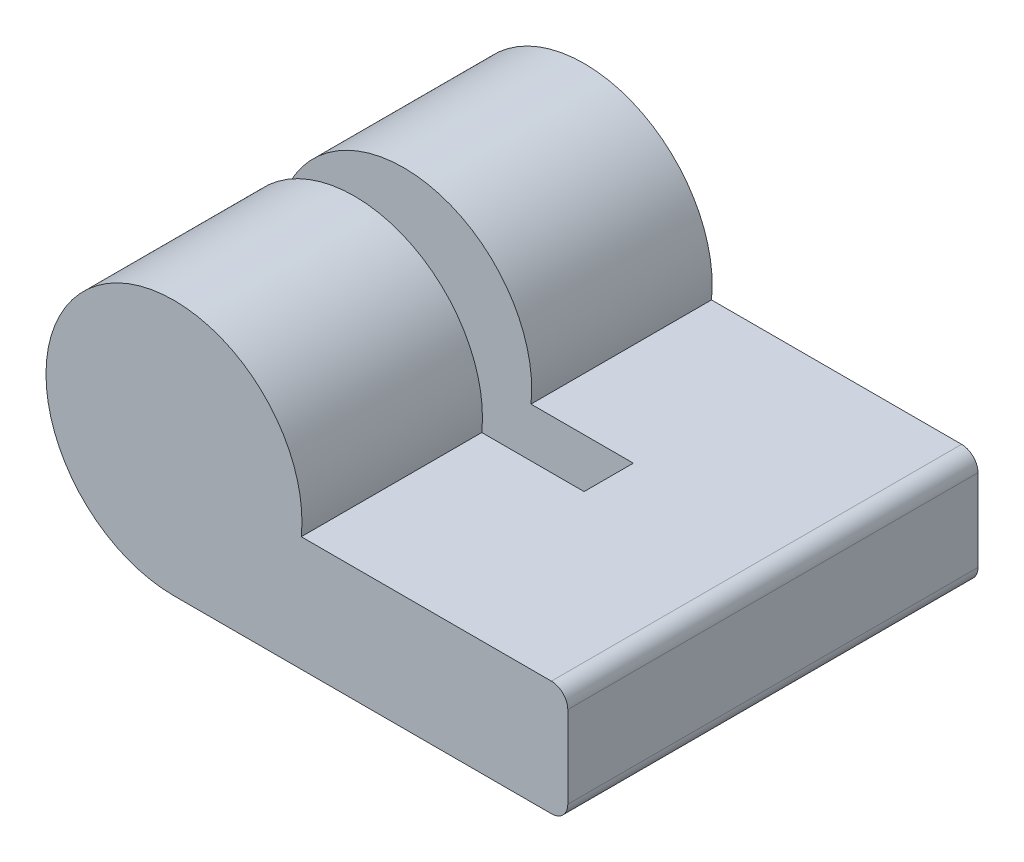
ISO-10303-21;
HEADER;
FILE_DESCRIPTION(('STEP AP214'),'2;1');
FILE_NAME('part.step','',(''),(''),'','','');
FILE_SCHEMA(('AUTOMOTIVE_DESIGN { 1 0 10303 214 1 1 1 1 }'));
ENDSEC;
DATA;
#1=APPLICATION_CONTEXT('core data for automotive mechanical design processes');
#2=APPLICATION_PROTOCOL_DEFINITION('international standard','automotive_design',2000,#1);
#3=PRODUCT_CONTEXT('',#1,'mechanical');
#4=PRODUCT('Part','Part','',(#3));
#5=PRODUCT_RELATED_PRODUCT_CATEGORY('part','',(#4));
#6=PRODUCT_DEFINITION_FORMATION('','',#4);
#7=PRODUCT_DEFINITION_CONTEXT('part definition',#1,'design');
#8=PRODUCT_DEFINITION('design','',#6,#7);
#9=PRODUCT_DEFINITION_SHAPE('','',#8);
#10=(LENGTH_UNIT() NAMED_UNIT(*) SI_UNIT(.MILLI.,.METRE.));
#11=(NAMED_UNIT(*) PLANE_ANGLE_UNIT() SI_UNIT($,.RADIAN.));
#12=(NAMED_UNIT(*) SI_UNIT($,.STERADIAN.) SOLID_ANGLE_UNIT());
#13=UNCERTAINTY_MEASURE_WITH_UNIT(LENGTH_MEASURE(1.E-05),#10,'distance_accuracy_value','');
#14=(GEOMETRIC_REPRESENTATION_CONTEXT(3) GLOBAL_UNCERTAINTY_ASSIGNED_CONTEXT((#13)) GLOBAL_UNIT_ASSIGNED_CONTEXT((#10,
#11,#12)) REPRESENTATION_CONTEXT('',''));
#15=CARTESIAN_POINT('',(0.,0.,0.));
#16=DIRECTION('',(0.,0.,1.));
#17=DIRECTION('',(1.,0.,0.));
#18=AXIS2_PLACEMENT_3D('',#15,#16,#17);
#19=CARTESIAN_POINT('',(0.,0.,12.5));
#20=DIRECTION('',(0.,0.,-1.));
#21=DIRECTION('',(-1.,0.,0.));
#22=AXIS2_PLACEMENT_3D('',#19,#20,#21);
#23=CYLINDRICAL_SURFACE('',#22,3.9);
#24=CARTESIAN_POINT('',(0.,0.,5.5));
#25=DIRECTION('',(0.,0.,1.));
#26=DIRECTION('',(1.,0.,0.));
#27=AXIS2_PLACEMENT_3D('',#24,#25,#26);
#28=CIRCLE('',#27,3.9);
#29=CARTESIAN_POINT('',(3.87943294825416,-0.400000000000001,5.5));
#30=VERTEX_POINT('',#29);
#31=CARTESIAN_POINT('',(0.,-3.9,5.5));
#32=VERTEX_POINT('',#31);
#33=EDGE_CURVE('E130',#30,#32,#28,.T.);
#34=ORIENTED_EDGE('',*,*,#33,.F.);
#35=DIRECTION('',(0.,0.,-1.));
#36=VECTOR('',#35,1.);
#37=CARTESIAN_POINT('',(3.87943294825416,-0.400000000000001,12.5));
#38=LINE('',#37,#36);
#39=CARTESIAN_POINT('',(3.87943294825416,-0.400000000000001,0.));
#40=VERTEX_POINT('',#39);
#41=EDGE_CURVE('E147',#30,#40,#38,.T.);
#42=ORIENTED_EDGE('',*,*,#41,.T.);
#43=CARTESIAN_POINT('',(0.,0.,0.));
#44=DIRECTION('',(0.,0.,1.));
#45=DIRECTION('',(1.,0.,0.));
#46=AXIS2_PLACEMENT_3D('',#43,#44,#45);
#47=CIRCLE('',#46,3.9);
#48=CARTESIAN_POINT('',(0.,-3.9,0.));
#49=VERTEX_POINT('',#48);
#50=EDGE_CURVE('E119',#40,#49,#47,.T.);
#51=ORIENTED_EDGE('',*,*,#50,.T.);
#52=DIRECTION('',(0.,0.,-1.));
#53=VECTOR('',#52,1.);
#54=CARTESIAN_POINT('',(0.,-3.9,12.5));
#55=LINE('',#54,#53);
#56=EDGE_CURVE('E160',#32,#49,#55,.T.);
#57=ORIENTED_EDGE('',*,*,#56,.F.);
#58=EDGE_LOOP('',(#34,#42,#51,#57));
#59=FACE_BOUND('',#58,.T.);
#60=ADVANCED_FACE('F32',(#59),#23,.T.);
#61=CARTESIAN_POINT('',(0.,-3.9,12.5));
#62=DIRECTION('',(0.,1.,0.));
#63=DIRECTION('',(0.,0.,1.));
#64=AXIS2_PLACEMENT_3D('',#61,#62,#63);
#65=PLANE('',#64);
#66=DIRECTION('',(1.,0.,0.));
#67=VECTOR('',#66,1.);
#68=CARTESIAN_POINT('',(0.,-3.9,5.5));
#69=LINE('',#68,#67);
#70=CARTESIAN_POINT('',(3.13256738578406,-3.9,5.5));
#71=VERTEX_POINT('',#70);
#72=EDGE_CURVE('E120',#32,#71,#69,.T.);
#73=ORIENTED_EDGE('',*,*,#72,.F.);
#74=ORIENTED_EDGE('',*,*,#56,.T.);
#75=DIRECTION('',(1.,0.,0.));
#76=VECTOR('',#75,1.);
#77=CARTESIAN_POINT('',(0.,-3.9,0.));
#78=LINE('',#77,#76);
#79=CARTESIAN_POINT('',(11.5,-3.9,0.));
#80=VERTEX_POINT('',#79);
#81=EDGE_CURVE('E150',#49,#80,#78,.T.);
#82=ORIENTED_EDGE('',*,*,#81,.T.);
#83=DIRECTION('',(0.,0.,-1.));
#84=VECTOR('',#83,1.);
#85=CARTESIAN_POINT('',(11.5,-3.9,12.5));
#86=LINE('',#85,#84);
#87=CARTESIAN_POINT('',(11.5,-3.9,12.5));
#88=VERTEX_POINT('',#87);
#89=EDGE_CURVE('E55',#80,#88,#86,.F.);
#90=ORIENTED_EDGE('',*,*,#89,.T.);
#91=DIRECTION('',(1.,0.,0.));
#92=VECTOR('',#91,1.);
#93=CARTESIAN_POINT('',(0.,-3.9,12.5));
#94=LINE('',#93,#92);
#95=CARTESIAN_POINT('',(0.,-3.9,12.5));
#96=VERTEX_POINT('',#95);
#97=EDGE_CURVE('E139',#96,#88,#94,.T.);
#98=ORIENTED_EDGE('',*,*,#97,.F.);
#99=CARTESIAN_POINT('',(0.,-3.9,7.));
#100=VERTEX_POINT('',#99);
#101=EDGE_CURVE('E129',#96,#100,#55,.T.);
#102=ORIENTED_EDGE('',*,*,#101,.T.);
#103=DIRECTION('',(1.,0.,0.));
#104=VECTOR('',#103,1.);
#105=CARTESIAN_POINT('',(0.,-3.9,7.));
#106=LINE('',#105,#104);
#107=CARTESIAN_POINT('',(3.13256738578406,-3.9,7.));
#108=VERTEX_POINT('',#107);
#109=EDGE_CURVE('E123',#100,#108,#106,.T.);
#110=ORIENTED_EDGE('',*,*,#109,.T.);
#111=DIRECTION('',(0.,0.,1.));
#112=VECTOR('',#111,1.);
#113=CARTESIAN_POINT('',(3.13256738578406,-3.9,5.5));
#114=LINE('',#113,#112);
#115=EDGE_CURVE('E110',#108,#71,#114,.F.);
#116=ORIENTED_EDGE('',*,*,#115,.T.);
#117=EDGE_LOOP('',(#73,#74,#82,#90,#98,#102,#110,#116));
#118=FACE_BOUND('',#117,.T.);
#119=ADVANCED_FACE('F127',(#118),#65,.F.);
#120=CARTESIAN_POINT('',(12.,-0.4,12.5));
#121=DIRECTION('',(0.,-1.,0.));
#122=DIRECTION('',(1.,0.,0.));
#123=AXIS2_PLACEMENT_3D('',#120,#121,#122);
#124=PLANE('',#123);
#125=DIRECTION('',(-1.,0.,0.));
#126=VECTOR('',#125,1.);
#127=CARTESIAN_POINT('',(12.,-0.4,5.5));
#128=LINE('',#127,#126);
#129=CARTESIAN_POINT('',(6.99636333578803,-0.400000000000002,5.5));
#130=VERTEX_POINT('',#129);
#131=EDGE_CURVE('E11',#130,#30,#128,.T.);
#132=ORIENTED_EDGE('',*,*,#131,.F.);
#133=DIRECTION('',(0.,0.,1.));
#134=VECTOR('',#133,1.);
#135=CARTESIAN_POINT('',(6.99636333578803,-0.400000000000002,5.5));
#136=LINE('',#135,#134);
#137=CARTESIAN_POINT('',(6.99636333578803,-0.400000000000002,7.));
#138=VERTEX_POINT('',#137);
#139=EDGE_CURVE('E40',#130,#138,#136,.T.);
#140=ORIENTED_EDGE('',*,*,#139,.T.);
#141=DIRECTION('',(-1.,0.,0.));
#142=VECTOR('',#141,1.);
#143=CARTESIAN_POINT('',(12.,-0.4,7.));
#144=LINE('',#143,#142);
#145=CARTESIAN_POINT('',(3.87943294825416,-0.400000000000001,7.));
#146=VERTEX_POINT('',#145);
#147=EDGE_CURVE('E124',#138,#146,#144,.T.);
#148=ORIENTED_EDGE('',*,*,#147,.T.);
#149=CARTESIAN_POINT('',(3.87943294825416,-0.400000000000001,12.5));
#150=VERTEX_POINT('',#149);
#151=EDGE_CURVE('E157',#150,#146,#38,.T.);
#152=ORIENTED_EDGE('',*,*,#151,.F.);
#153=DIRECTION('',(-1.,0.,0.));
#154=VECTOR('',#153,1.);
#155=CARTESIAN_POINT('',(12.,-0.4,12.5));
#156=LINE('',#155,#154);
#157=CARTESIAN_POINT('',(11.5,-0.4,12.5));
#158=VERTEX_POINT('',#157);
#159=EDGE_CURVE('E145',#158,#150,#156,.T.);
#160=ORIENTED_EDGE('',*,*,#159,.F.);
#161=DIRECTION('',(0.,0.,-1.));
#162=VECTOR('',#161,1.);
#163=CARTESIAN_POINT('',(11.5,-0.4,12.5));
#164=LINE('',#163,#162);
#165=CARTESIAN_POINT('',(11.5,-0.4,0.));
#166=VERTEX_POINT('',#165);
#167=EDGE_CURVE('E162',#158,#166,#164,.T.);
#168=ORIENTED_EDGE('',*,*,#167,.T.);
#169=DIRECTION('',(-1.,0.,0.));
#170=VECTOR('',#169,1.);
#171=CARTESIAN_POINT('',(12.,-0.4,0.));
#172=LINE('',#171,#170);
#173=EDGE_CURVE('E140',#166,#40,#172,.T.);
#174=ORIENTED_EDGE('',*,*,#173,.T.);
#175=ORIENTED_EDGE('',*,*,#41,.F.);
#176=EDGE_LOOP('',(#132,#140,#148,#152,#160,#168,#174,#175));
#177=FACE_BOUND('',#176,.T.);
#178=ADVANCED_FACE('F181',(#177),#124,.F.);
#179=ORIENTED_EDGE('',*,*,#151,.T.);
#180=CARTESIAN_POINT('',(0.,0.,7.));
#181=DIRECTION('',(0.,0.,1.));
#182=DIRECTION('',(1.,0.,0.));
#183=AXIS2_PLACEMENT_3D('',#180,#181,#182);
#184=CIRCLE('',#183,3.9);
#185=EDGE_CURVE('E47',#146,#100,#184,.T.);
#186=ORIENTED_EDGE('',*,*,#185,.T.);
#187=ORIENTED_EDGE('',*,*,#101,.F.);
#188=CARTESIAN_POINT('',(0.,0.,12.5));
#189=DIRECTION('',(0.,0.,1.));
#190=DIRECTION('',(1.,0.,0.));
#191=AXIS2_PLACEMENT_3D('',#188,#189,#190);
#192=CIRCLE('',#191,3.9);
#193=EDGE_CURVE('E136',#150,#96,#192,.T.);
#194=ORIENTED_EDGE('',*,*,#193,.F.);
#195=EDGE_LOOP('',(#179,#186,#187,#194));
#196=FACE_BOUND('',#195,.T.);
#197=ADVANCED_FACE('F212',(#196),#23,.T.);
#198=CARTESIAN_POINT('',(12.,-3.9,12.5));
#199=DIRECTION('',(-1.,0.,0.));
#200=DIRECTION('',(0.,0.,1.));
#201=AXIS2_PLACEMENT_3D('',#198,#199,#200);
#202=PLANE('',#201);
#203=DIRECTION('',(0.,1.,0.));
#204=VECTOR('',#203,1.);
#205=CARTESIAN_POINT('',(12.,-3.9,0.));
#206=LINE('',#205,#204);
#207=CARTESIAN_POINT('',(12.,-3.4,0.));
#208=VERTEX_POINT('',#207);
#209=CARTESIAN_POINT('',(12.,-0.9,0.));
#210=VERTEX_POINT('',#209);
#211=EDGE_CURVE('E152',#208,#210,#206,.T.);
#212=ORIENTED_EDGE('',*,*,#211,.T.);
#213=DIRECTION('',(0.,0.,-1.));
#214=VECTOR('',#213,1.);
#215=CARTESIAN_POINT('',(12.,-0.9,12.5));
#216=LINE('',#215,#214);
#217=CARTESIAN_POINT('',(12.,-0.9,12.5));
#218=VERTEX_POINT('',#217);
#219=EDGE_CURVE('E172',#210,#218,#216,.F.);
#220=ORIENTED_EDGE('',*,*,#219,.T.);
#221=DIRECTION('',(0.,1.,0.));
#222=VECTOR('',#221,1.);
#223=CARTESIAN_POINT('',(12.,-3.9,12.5));
#224=LINE('',#223,#222);
#225=CARTESIAN_POINT('',(12.,-3.4,12.5));
#226=VERTEX_POINT('',#225);
#227=EDGE_CURVE('E142',#226,#218,#224,.T.);
#228=ORIENTED_EDGE('',*,*,#227,.F.);
#229=DIRECTION('',(0.,0.,-1.));
#230=VECTOR('',#229,1.);
#231=CARTESIAN_POINT('',(12.,-3.4,12.5));
#232=LINE('',#231,#230);
#233=EDGE_CURVE('E169',#226,#208,#232,.T.);
#234=ORIENTED_EDGE('',*,*,#233,.T.);
#235=EDGE_LOOP('',(#212,#220,#228,#234));
#236=FACE_BOUND('',#235,.T.);
#237=ADVANCED_FACE('F204',(#236),#202,.F.);
#238=CARTESIAN_POINT('',(0.,0.,12.5));
#239=DIRECTION('',(0.,0.,1.));
#240=DIRECTION('',(1.,0.,0.));
#241=AXIS2_PLACEMENT_3D('',#238,#239,#240);
#242=PLANE('',#241);
#243=ORIENTED_EDGE('',*,*,#227,.T.);
#244=CARTESIAN_POINT('',(11.5,-0.9,12.5));
#245=DIRECTION('',(0.,0.,1.));
#246=DIRECTION('',(1.,0.,0.));
#247=AXIS2_PLACEMENT_3D('',#244,#245,#246);
#248=CIRCLE('',#247,0.5);
#249=EDGE_CURVE('E176',#218,#158,#248,.T.);
#250=ORIENTED_EDGE('',*,*,#249,.T.);
#251=ORIENTED_EDGE('',*,*,#159,.T.);
#252=ORIENTED_EDGE('',*,*,#193,.T.);
#253=ORIENTED_EDGE('',*,*,#97,.T.);
#254=CARTESIAN_POINT('',(11.5,-3.4,12.5));
#255=DIRECTION('',(0.,0.,1.));
#256=DIRECTION('',(1.,0.,0.));
#257=AXIS2_PLACEMENT_3D('',#254,#255,#256);
#258=CIRCLE('',#257,0.5);
#259=EDGE_CURVE('E174',#88,#226,#258,.T.);
#260=ORIENTED_EDGE('',*,*,#259,.T.);
#261=EDGE_LOOP('',(#243,#250,#251,#252,#253,#260));
#262=FACE_BOUND('',#261,.T.);
#263=ADVANCED_FACE('F201',(#262),#242,.T.);
#264=CARTESIAN_POINT('',(0.,0.,0.));
#265=DIRECTION('',(0.,0.,1.));
#266=DIRECTION('',(1.,0.,0.));
#267=AXIS2_PLACEMENT_3D('',#264,#265,#266);
#268=PLANE('',#267);
#269=ORIENTED_EDGE('',*,*,#173,.F.);
#270=CARTESIAN_POINT('',(11.5,-0.9,0.));
#271=DIRECTION('',(0.,0.,1.));
#272=DIRECTION('',(1.,0.,0.));
#273=AXIS2_PLACEMENT_3D('',#270,#271,#272);
#274=CIRCLE('',#273,0.5);
#275=EDGE_CURVE('E167',#166,#210,#274,.F.);
#276=ORIENTED_EDGE('',*,*,#275,.T.);
#277=ORIENTED_EDGE('',*,*,#211,.F.);
#278=CARTESIAN_POINT('',(11.5,-3.4,0.));
#279=DIRECTION('',(0.,0.,1.));
#280=DIRECTION('',(1.,0.,0.));
#281=AXIS2_PLACEMENT_3D('',#278,#279,#280);
#282=CIRCLE('',#281,0.5);
#283=EDGE_CURVE('E165',#208,#80,#282,.F.);
#284=ORIENTED_EDGE('',*,*,#283,.T.);
#285=ORIENTED_EDGE('',*,*,#81,.F.);
#286=ORIENTED_EDGE('',*,*,#50,.F.);
#287=EDGE_LOOP('',(#269,#276,#277,#284,#285,#286));
#288=FACE_BOUND('',#287,.T.);
#289=ADVANCED_FACE('F194',(#288),#268,.F.);
#290=CARTESIAN_POINT('',(11.5,-0.9,12.5));
#291=DIRECTION('',(0.,0.,-1.));
#292=DIRECTION('',(-1.,0.,0.));
#293=AXIS2_PLACEMENT_3D('',#290,#291,#292);
#294=CYLINDRICAL_SURFACE('',#293,0.5);
#295=ORIENTED_EDGE('',*,*,#249,.F.);
#296=ORIENTED_EDGE('',*,*,#219,.F.);
#297=ORIENTED_EDGE('',*,*,#275,.F.);
#298=ORIENTED_EDGE('',*,*,#167,.F.);
#299=EDGE_LOOP('',(#295,#296,#297,#298));
#300=FACE_BOUND('',#299,.T.);
#301=ADVANCED_FACE('F207',(#300),#294,.T.);
#302=CARTESIAN_POINT('',(11.5,-3.4,12.5));
#303=DIRECTION('',(0.,0.,-1.));
#304=DIRECTION('',(-1.,0.,0.));
#305=AXIS2_PLACEMENT_3D('',#302,#303,#304);
#306=CYLINDRICAL_SURFACE('',#305,0.5);
#307=ORIENTED_EDGE('',*,*,#259,.F.);
#308=ORIENTED_EDGE('',*,*,#89,.F.);
#309=ORIENTED_EDGE('',*,*,#283,.F.);
#310=ORIENTED_EDGE('',*,*,#233,.F.);
#311=EDGE_LOOP('',(#307,#308,#309,#310));
#312=FACE_BOUND('',#311,.T.);
#313=ADVANCED_FACE('F34',(#312),#306,.T.);
#314=CARTESIAN_POINT('',(-15.,20.,5.5));
#315=DIRECTION('',(0.,0.,1.));
#316=DIRECTION('',(1.,0.,0.));
#317=AXIS2_PLACEMENT_3D('',#314,#315,#316);
#318=CYLINDRICAL_SURFACE('',#317,30.);
#319=CARTESIAN_POINT('',(-15.,20.,7.));
#320=DIRECTION('',(0.,0.,1.));
#321=DIRECTION('',(1.,0.,0.));
#322=AXIS2_PLACEMENT_3D('',#319,#320,#321);
#323=CIRCLE('',#322,30.);
#324=EDGE_CURVE('E113',#108,#138,#323,.T.);
#325=ORIENTED_EDGE('',*,*,#324,.T.);
#326=ORIENTED_EDGE('',*,*,#139,.F.);
#327=CARTESIAN_POINT('',(-15.,20.,5.5));
#328=DIRECTION('',(0.,0.,1.));
#329=DIRECTION('',(1.,0.,0.));
#330=AXIS2_PLACEMENT_3D('',#327,#328,#329);
#331=CIRCLE('',#330,30.);
#332=EDGE_CURVE('E116',#71,#130,#331,.T.);
#333=ORIENTED_EDGE('',*,*,#332,.F.);
#334=ORIENTED_EDGE('',*,*,#115,.F.);
#335=EDGE_LOOP('',(#325,#326,#333,#334));
#336=FACE_BOUND('',#335,.T.);
#337=ADVANCED_FACE('F112',(#336),#318,.F.);
#338=CARTESIAN_POINT('',(-15.,20.,5.5));
#339=DIRECTION('',(0.,0.,1.));
#340=DIRECTION('',(1.,0.,0.));
#341=AXIS2_PLACEMENT_3D('',#338,#339,#340);
#342=PLANE('',#341);
#343=ORIENTED_EDGE('',*,*,#72,.T.);
#344=ORIENTED_EDGE('',*,*,#332,.T.);
#345=ORIENTED_EDGE('',*,*,#131,.T.);
#346=ORIENTED_EDGE('',*,*,#33,.T.);
#347=EDGE_LOOP('',(#343,#344,#345,#346));
#348=FACE_BOUND('',#347,.T.);
#349=ADVANCED_FACE('F185',(#348),#342,.T.);
#350=CARTESIAN_POINT('',(-15.,20.,7.));
#351=DIRECTION('',(0.,0.,1.));
#352=DIRECTION('',(1.,0.,0.));
#353=AXIS2_PLACEMENT_3D('',#350,#351,#352);
#354=PLANE('',#353);
#355=ORIENTED_EDGE('',*,*,#185,.F.);
#356=ORIENTED_EDGE('',*,*,#147,.F.);
#357=ORIENTED_EDGE('',*,*,#324,.F.);
#358=ORIENTED_EDGE('',*,*,#109,.F.);
#359=EDGE_LOOP('',(#355,#356,#357,#358));
#360=FACE_BOUND('',#359,.T.);
#361=ADVANCED_FACE('F122',(#360),#354,.F.);
#362=CLOSED_SHELL('',(#60,#119,#178,#197,#237,#263,#289,#301,#313,#337,#349,#361));
#363=MANIFOLD_SOLID_BREP('B2',#362);
#364=ADVANCED_BREP_SHAPE_REPRESENTATION('',(#18,#363),#14);
#365=SHAPE_DEFINITION_REPRESENTATION(#9,#364);
ENDSEC;
END-ISO-10303-21;
